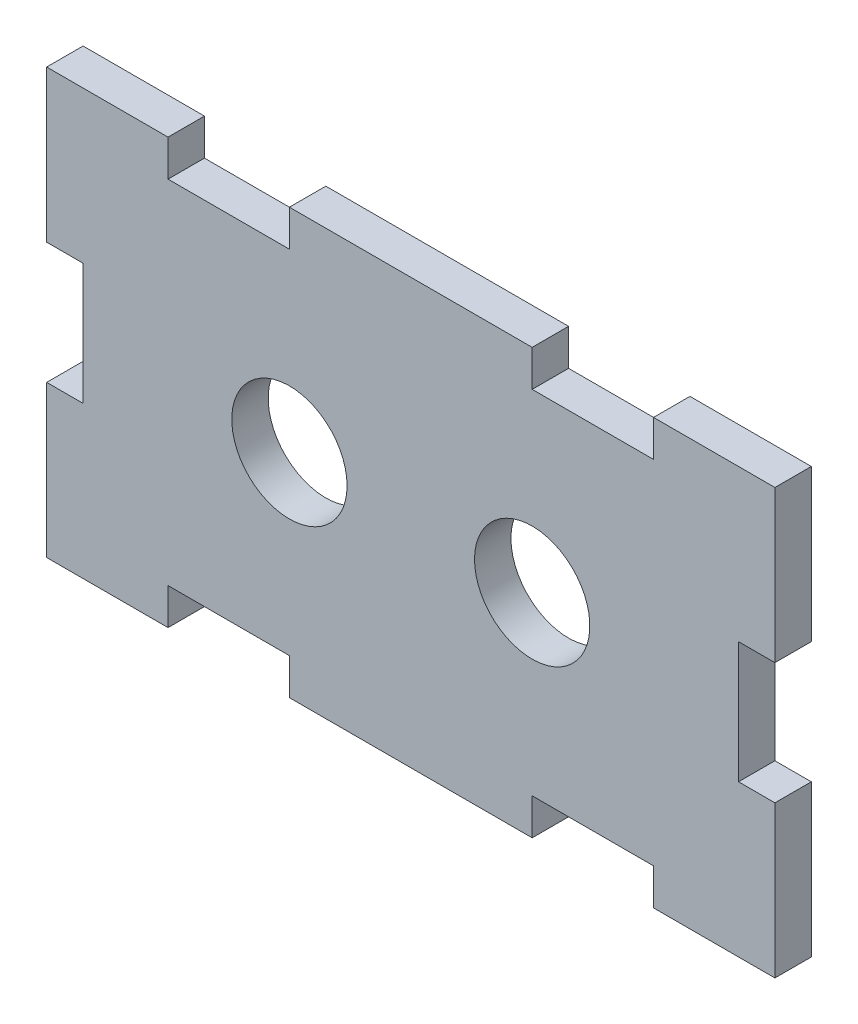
from build123d import *

# Parameters (mm, degrees)
CROQUIS1_W                = 60
CROQUIS1_H                = 35
CROQUIS1_R                = 4.75
SALIENTE_EXTRUIR2_DEPTH   = 3
CROQUIS2_W                = 10
CROQUIS2_H                = 3
CORTAR_EXTRUIR1_DEPTH     = 3
SIMETR_A2_COPY_1_SKETCH_W = 10
SIMETR_A2_COPY_1_SKETCH_H = 3
SIMETR_A2_COPY_1_DEPTH    = 3
CROQUIS3_W                = 3
CROQUIS3_H                = 10
CORTAR_EXTRUIR2_DEPTH     = 3


with BuildPart() as part:
    # Croquis1 → Saliente-Extruir2 (new body)
    with BuildSketch(Plane.XY):
        Rectangle(CROQUIS1_W, CROQUIS1_H)
        with Locations((-10, 0)):
            Circle(CROQUIS1_R, mode=Mode.SUBTRACT)
        with Locations(Location((10, 0, 0), (0, 0, 180))):
            Circle(CROQUIS1_R, mode=Mode.SUBTRACT)
    extrude(amount=SALIENTE_EXTRUIR2_DEPTH)

    # Croquis2 → Cortar-Extruir1 (cut)
    with BuildSketch(Plane.XY.offset(3)):
        with Locations((-15, 16)):
            Rectangle(CROQUIS2_W, CROQUIS2_H)
    cortar_extruir1 = extrude(amount=-CORTAR_EXTRUIR1_DEPTH, mode=Mode.SUBTRACT)

    # Simetr_a1: Cortar-Extruir1 across plane
    add(cortar_extruir1.mirror(Plane(origin=(0, 0, 0), x_dir=(0, 0, 1), z_dir=(1, 0, 0))), mode=Mode.SUBTRACT)

    # Simetr_a2: Cortar-Extruir1 across plane
    add(cortar_extruir1.mirror(Plane.ZX), mode=Mode.SUBTRACT)

    # Simetr_a2 copy 1 sketch → Simetr_a2 copy 1 (cut)
    with BuildSketch(Plane(origin=(0, 0, 3), x_dir=(-1, 0, 0), z_dir=(0, 0, 1))):
        with Locations((-15, 16)):
            Rectangle(SIMETR_A2_COPY_1_SKETCH_W, SIMETR_A2_COPY_1_SKETCH_H)
    extrude(amount=-SIMETR_A2_COPY_1_DEPTH, mode=Mode.SUBTRACT)

    # Croquis3 → Cortar-Extruir2 (cut)
    with BuildSketch(Plane.XY.offset(3)):
        with Locations((-28.5, 0)):
            Rectangle(CROQUIS3_W, CROQUIS3_H)
    cortar_extruir2 = extrude(amount=-CORTAR_EXTRUIR2_DEPTH, mode=Mode.SUBTRACT)

    # Simetr_a3: Cortar-Extruir2 across plane
    add(cortar_extruir2.mirror(Plane(origin=(0, 0, 0), x_dir=(0, 0, 1), z_dir=(1, 0, 0))), mode=Mode.SUBTRACT)


solid = part.part
